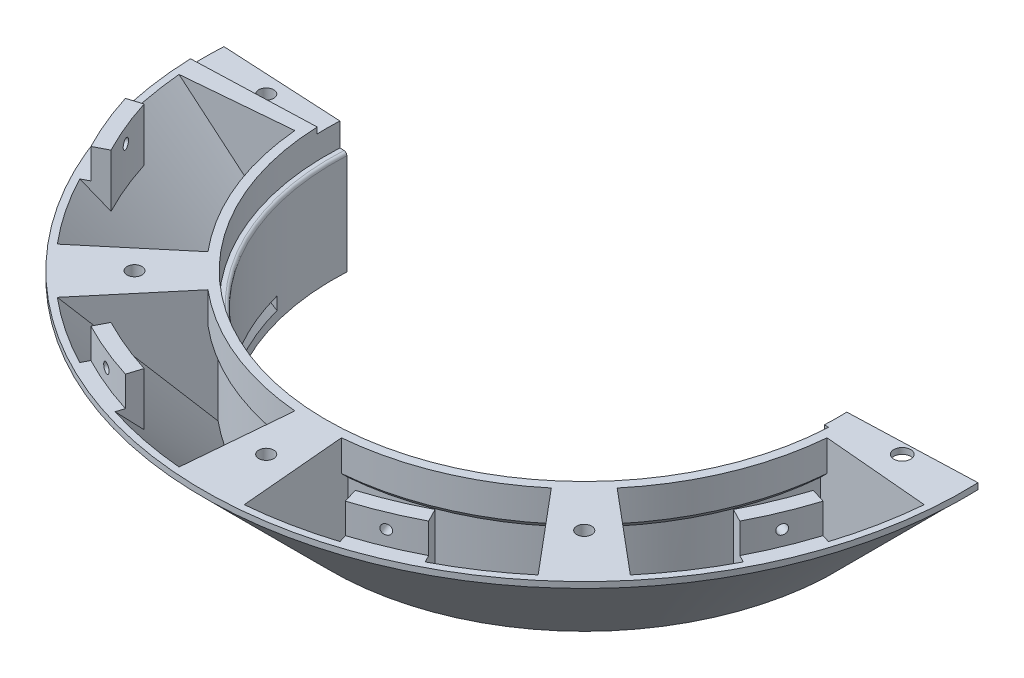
from build123d import *

# Parameters (mm, degrees)
CIRPATTERN1_COUNT               = 8
CUT_REVOLVE2_ANGLE              = 35
CUT_REVOLVE3_ANGLE              = 15
REVOLVE4_ANGLE                  = 10
F_8_32_TAPPED_HOLE1_D           = 4.1656
CIRPATTERN2_COUNT               = 8
CUT_EXTRUDE1_DEPTH              = 240.224517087
CUT_EXTRUDE2_START              = -2.54
CUT_EXTRUDE2_DEPTH              = 2.54
BOSS_EXTRUDE6_DEPTH             = 2.54
F_9_32_0_28125_DIAMETER_HOLE1_D = 7.14375


with BuildPart() as part:
    # Sketch1 → Revolve1 (revolve)
    with BuildSketch(Plane.XY, mode=Mode.PRIVATE) as revolve1_sk:
        with BuildLine():
            Line((-117.883802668, 25.146), (-109.7915, 25.146))
            Line((-109.7915, 25.146), (-109.7915, 12.7))
            Line((-109.7915, 12.7), (-107.9627, 12.7))
            ThreePointArc((-107.9627, 12.7), (-107.064674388, 12.328025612), (-106.6927, 11.43))
            Line((-106.6927, 11.43), (-106.6927, -31.3563))
            Line((-106.6927, -31.3563), (-107.9627, -31.3563))
            Line((-107.9627, -31.3563), (-161.925, 22.606))
            Line((-161.925, 22.606), (-161.925, 25.146))
            Line((-161.925, 25.146), (-117.883802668, 25.146))
        make_face()
    revolve(revolve1_sk.sketch.rotate(Axis((0, 0, 0), (0, 1, 0)), 270), axis=Axis((0, 0, 0), (0, 1, 0)))

    # Sketch15 → 1_4-20 Tapped Hole1 (revolve, cut)
    with BuildSketch(Plane(origin=(135.255, 25.146, 0), x_dir=(0, 0, 1), z_dir=(1, 0, 0))):
        Polygon((0, 0), (0, 18.043816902), (2.5527, 16.51), (2.5527, 12.7), (3.175, 12.7), (3.175, 0), align=None)
    f_1_4_20_tapped_hole1 = revolve(axis=Axis((135.255, 31.496, 0), (0, -1, 0)), mode=Mode.SUBTRACT)

    # CirPattern1: 1_4-20 Tapped Hole1 ×8 about axis
    cirpattern1_axis = Axis((0, 0, 0), (0, 1, 0))
    for i in range(1, CIRPATTERN1_COUNT):
        add(f_1_4_20_tapped_hole1.rotate(cirpattern1_axis, i * 360 / CIRPATTERN1_COUNT), mode=Mode.SUBTRACT)

    # Sketch25 → Cut-Revolve2 (revolve, symmetric, cut)
    with BuildSketch(Plane(origin=(-153.469815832, 0, 63.569279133), x_dir=(-0.9238795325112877, 0, 0.38268343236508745), z_dir=(-0.38268343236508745, 0, -0.9238795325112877))) as cut_revolve2_sk:
        Polygon((-279.716031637, 25.146), (-279.716031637, 11.9888), (-276.617231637, 8.89), (-276.617231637, -23.428146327), (-325.191377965, 25.146), align=None)
    cut_revolve2 = revolve(axis=Axis((0, 55.632543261, 0), (0, -1, 0)), revolution_arc=CUT_REVOLVE2_ANGLE / 2, mode=Mode.SUBTRACT)
    cut_revolve2 = cut_revolve2 + revolve(cut_revolve2_sk.sketch, axis=Axis((0, 55.632543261, 0), (0, 1, 0)), revolution_arc=CUT_REVOLVE2_ANGLE / 2, mode=Mode.SUBTRACT)

    # Sketch26 → Cut-Revolve3 (revolve, symmetric, cut)
    with BuildSketch(Plane(origin=(0, 0, 0), x_dir=(-0.9238795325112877, 0, 0.38268343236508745), z_dir=(-0.38268343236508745, 0, -0.9238795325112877))) as cut_revolve3_sk:
        Polygon((-110.5027, -23.428146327), (-106.6927, -27.238146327), (-106.6927, -21.849992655), (-110.5027, -18.039992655), align=None)
    cut_revolve3 = revolve(axis=Axis((0, 55.632543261, 0), (0, -1, 0)), revolution_arc=CUT_REVOLVE3_ANGLE / 2, mode=Mode.SUBTRACT)
    cut_revolve3 = cut_revolve3 + revolve(cut_revolve3_sk.sketch, axis=Axis((0, 55.632543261, 0), (0, 1, 0)), revolution_arc=CUT_REVOLVE3_ANGLE / 2, mode=Mode.SUBTRACT)

    # Sketch31 → Revolve4 (revolve, symmetric)
    with BuildSketch(Plane(origin=(0, 0, 0), x_dir=(-0.9238795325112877, 0, 0.38268343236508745), z_dir=(-0.38268343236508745, 0, -0.9238795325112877))) as revolve4_sk:
        Polygon((-159.076846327, 25.146), (-149.225, 15.294153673), (-149.225, 37.846), (-155.575, 37.846), (-155.575, 25.146), align=None)
    revolve4 = revolve(axis=Axis((0, 0, 0), (0, 1, 0)), revolution_arc=REVOLVE4_ANGLE / 2)
    revolve4 = revolve4 + revolve(revolve4_sk.sketch, axis=Axis((0, 0, 0), (0, -1, 0)), revolution_arc=REVOLVE4_ANGLE / 2)

    # 8-32 Tapped Hole1 (through all)
    with Locations(Plane(origin=(143.73255827, 31.496, -59.53597499), x_dir=(0.382683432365, 0, 0.923879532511), z_dir=(0.923879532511, 0, -0.382683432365))):
        with Locations((0, 0)):
            f_8_32_tapped_hole1 = Hole(F_8_32_TAPPED_HOLE1_D / 2)

    # CirPattern2: Cut-Revolve2, Cut-Revolve3, Revolve4, 8-32 Tapped Hole1 ×8 about axis
    cirpattern2_axis = Axis((0, 0, 0), (0, 1, 0))
    add([cut_revolve2.rotate(cirpattern2_axis, i * 360 / CIRPATTERN2_COUNT) for i in range(1, CIRPATTERN2_COUNT)], mode=Mode.SUBTRACT)
    add([cut_revolve3.rotate(cirpattern2_axis, i * 360 / CIRPATTERN2_COUNT) for i in range(1, CIRPATTERN2_COUNT)], mode=Mode.SUBTRACT)
    add([revolve4.rotate(cirpattern2_axis, i * 360 / CIRPATTERN2_COUNT) for i in range(1, CIRPATTERN2_COUNT)])
    add([f_8_32_tapped_hole1.rotate(cirpattern2_axis, i * 360 / CIRPATTERN2_COUNT) for i in range(1, CIRPATTERN2_COUNT)], mode=Mode.SUBTRACT)

    # Sketch21 → Cut-Extrude1 (cut, through all)
    with BuildSketch(Plane.XZ.offset(-37.846)):
        Polygon((-161.703087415, -8.474499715), (161.925, 8.48612966), (161.925, -168.577043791), (-161.703087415, -168.577043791), align=None)
    extrude(amount=CUT_EXTRUDE1_DEPTH, mode=Mode.SUBTRACT)

    # Sketch22 → Cut-Extrude2 (cut)
    with BuildSketch(Plane(origin=(0, 25.146, 0), x_dir=(1, 0, 0), z_dir=(0, 1, 0)).offset(CUT_EXTRUDE2_START)):
        with BuildLine():
            Line((-161.826359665, -5.651101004), (-107.89693204, -3.767843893))
            ThreePointArc((-107.89693204, -3.767843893), (-107.958589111, 0.942140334), (-107.814740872, 5.650331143))
            Line((-107.814740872, 5.650331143), (-161.703087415, 8.474499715))
            ThreePointArc((-161.703087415, 8.474499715), (-161.918834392, 1.413044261), (-161.826359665, -5.651101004))
        make_face()
    extrude(amount=CUT_EXTRUDE2_DEPTH, mode=Mode.SUBTRACT)

    # Sketch23 → Boss-Extrude6 (add)
    with BuildSketch(Plane(origin=(0, 25.146, 0), x_dir=(1, 0, 0), z_dir=(0, 1, 0))):
        with BuildLine():
            Line((107.89693204, 3.767843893), (161.826359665, 5.651101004))
            ThreePointArc((161.826359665, 5.651101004), (161.918834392, -1.413044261), (161.703087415, -8.474499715))
            Line((161.703087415, -8.474499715), (107.814740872, -5.650331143))
            ThreePointArc((107.814740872, -5.650331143), (107.958589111, -0.942140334), (107.89693204, 3.767843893))
        make_face()
    extrude(amount=-BOSS_EXTRUDE6_DEPTH)

    # 9_32 _0.28125_ Diameter Hole1 (through all)
    with Locations(Plane(origin=(0, 25.146, 0), x_dir=(1, 0, 0), z_dir=(0, 1, 0))):
        with Locations((135.255, 0)):
            Hole(F_9_32_0_28125_DIAMETER_HOLE1_D / 2)


solid = part.part
